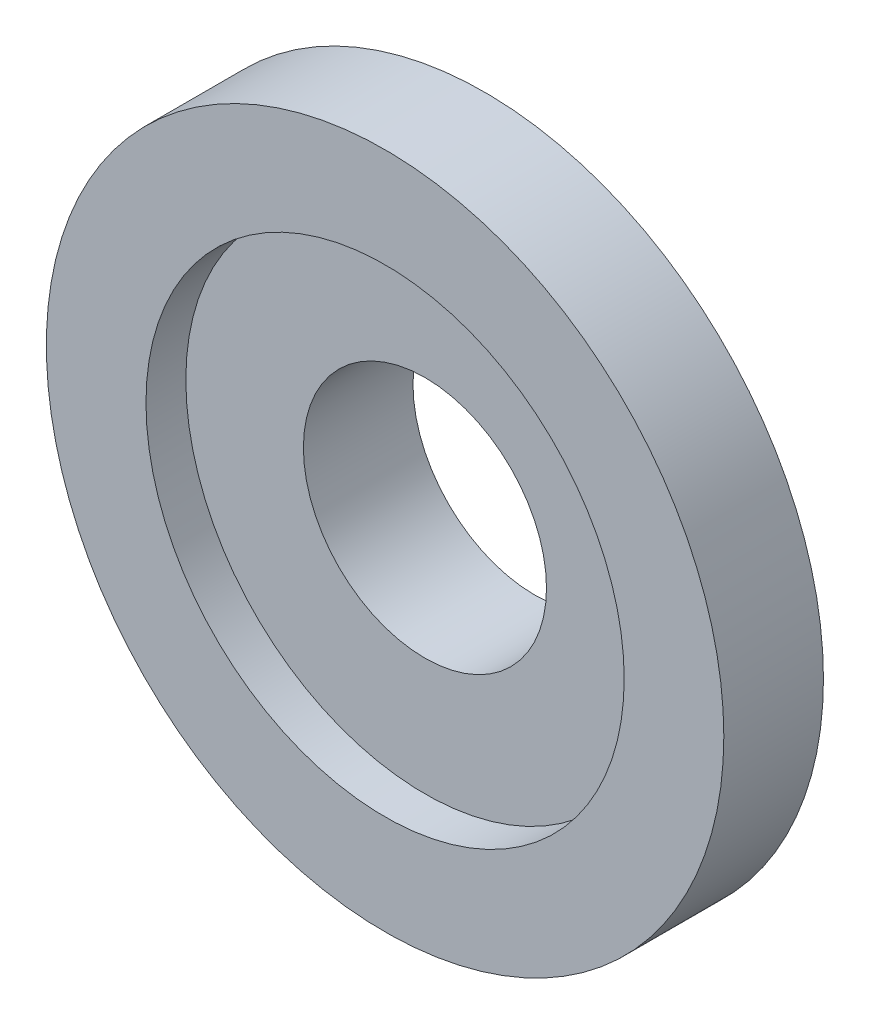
ISO-10303-21;
HEADER;
FILE_DESCRIPTION(('STEP AP214'),'2;1');
FILE_NAME('part.step','',(''),(''),'','','');
FILE_SCHEMA(('AUTOMOTIVE_DESIGN { 1 0 10303 214 1 1 1 1 }'));
ENDSEC;
DATA;
#1=APPLICATION_CONTEXT('core data for automotive mechanical design processes');
#2=APPLICATION_PROTOCOL_DEFINITION('international standard','automotive_design',2000,#1);
#3=PRODUCT_CONTEXT('',#1,'mechanical');
#4=PRODUCT('Part','Part','',(#3));
#5=PRODUCT_RELATED_PRODUCT_CATEGORY('part','',(#4));
#6=PRODUCT_DEFINITION_FORMATION('','',#4);
#7=PRODUCT_DEFINITION_CONTEXT('part definition',#1,'design');
#8=PRODUCT_DEFINITION('design','',#6,#7);
#9=PRODUCT_DEFINITION_SHAPE('','',#8);
#10=(LENGTH_UNIT() NAMED_UNIT(*) SI_UNIT(.MILLI.,.METRE.));
#11=(NAMED_UNIT(*) PLANE_ANGLE_UNIT() SI_UNIT($,.RADIAN.));
#12=(NAMED_UNIT(*) SI_UNIT($,.STERADIAN.) SOLID_ANGLE_UNIT());
#13=UNCERTAINTY_MEASURE_WITH_UNIT(LENGTH_MEASURE(1.E-05),#10,'distance_accuracy_value','');
#14=(GEOMETRIC_REPRESENTATION_CONTEXT(3) GLOBAL_UNCERTAINTY_ASSIGNED_CONTEXT((#13)) GLOBAL_UNIT_ASSIGNED_CONTEXT((#10,
#11,#12)) REPRESENTATION_CONTEXT('',''));
#15=CARTESIAN_POINT('',(0.,0.,0.));
#16=DIRECTION('',(0.,0.,1.));
#17=DIRECTION('',(1.,0.,0.));
#18=AXIS2_PLACEMENT_3D('',#15,#16,#17);
#19=CARTESIAN_POINT('',(0.,0.,3.));
#20=DIRECTION('',(0.,0.,1.));
#21=DIRECTION('',(1.,0.,0.));
#22=AXIS2_PLACEMENT_3D('',#19,#20,#21);
#23=PLANE('',#22);
#24=CARTESIAN_POINT('',(0.,0.,3.));
#25=DIRECTION('',(0.,0.,-1.));
#26=DIRECTION('',(-1.,0.,0.));
#27=AXIS2_PLACEMENT_3D('',#24,#25,#26);
#28=CIRCLE('',#27,6.1);
#29=CARTESIAN_POINT('',(-6.1,0.,3.));
#30=VERTEX_POINT('',#29);
#31=EDGE_CURVE('E60',#30,#30,#28,.T.);
#32=ORIENTED_EDGE('',*,*,#31,.T.);
#33=EDGE_LOOP('',(#32));
#34=FACE_BOUND('',#33,.T.);
#35=CARTESIAN_POINT('',(0.,0.,3.));
#36=DIRECTION('',(0.,0.,1.));
#37=DIRECTION('',(1.,0.,0.));
#38=AXIS2_PLACEMENT_3D('',#35,#36,#37);
#39=CIRCLE('',#38,12.);
#40=CARTESIAN_POINT('',(12.,0.,3.));
#41=VERTEX_POINT('',#40);
#42=EDGE_CURVE('E10',#41,#41,#39,.F.);
#43=ORIENTED_EDGE('',*,*,#42,.F.);
#44=EDGE_LOOP('',(#43));
#45=FACE_BOUND('',#44,.T.);
#46=ADVANCED_FACE('F37',(#34,#45),#23,.T.);
#47=CARTESIAN_POINT('',(0.,0.,0.));
#48=DIRECTION('',(0.,0.,1.));
#49=DIRECTION('',(1.,0.,0.));
#50=AXIS2_PLACEMENT_3D('',#47,#48,#49);
#51=PLANE('',#50);
#52=CARTESIAN_POINT('',(0.,0.,0.));
#53=DIRECTION('',(0.,0.,1.));
#54=DIRECTION('',(1.,0.,0.));
#55=AXIS2_PLACEMENT_3D('',#52,#53,#54);
#56=CIRCLE('',#55,7.5);
#57=CARTESIAN_POINT('',(7.5,0.,0.));
#58=VERTEX_POINT('',#57);
#59=EDGE_CURVE('E44',#58,#58,#56,.F.);
#60=ORIENTED_EDGE('',*,*,#59,.F.);
#61=EDGE_LOOP('',(#60));
#62=FACE_BOUND('',#61,.T.);
#63=CARTESIAN_POINT('',(0.,0.,0.));
#64=DIRECTION('',(0.,0.,-1.));
#65=DIRECTION('',(-1.,0.,0.));
#66=AXIS2_PLACEMENT_3D('',#63,#64,#65);
#67=CIRCLE('',#66,10.);
#68=CARTESIAN_POINT('',(-10.,0.,0.));
#69=VERTEX_POINT('',#68);
#70=EDGE_CURVE('E70',#69,#69,#67,.T.);
#71=ORIENTED_EDGE('',*,*,#70,.T.);
#72=EDGE_LOOP('',(#71));
#73=FACE_BOUND('',#72,.T.);
#74=ADVANCED_FACE('F98',(#62,#73),#51,.F.);
#75=CARTESIAN_POINT('',(0.,0.,3.));
#76=DIRECTION('',(0.,0.,-1.));
#77=DIRECTION('',(-1.,0.,0.));
#78=AXIS2_PLACEMENT_3D('',#75,#76,#77);
#79=CYLINDRICAL_SURFACE('',#78,17.);
#80=CARTESIAN_POINT('',(0.,0.,0.));
#81=DIRECTION('',(0.,0.,1.));
#82=DIRECTION('',(1.,0.,0.));
#83=AXIS2_PLACEMENT_3D('',#80,#81,#82);
#84=CIRCLE('',#83,17.);
#85=CARTESIAN_POINT('',(17.,0.,0.));
#86=VERTEX_POINT('',#85);
#87=EDGE_CURVE('E48',#86,#86,#84,.T.);
#88=ORIENTED_EDGE('',*,*,#87,.T.);
#89=EDGE_LOOP('',(#88));
#90=FACE_BOUND('',#89,.T.);
#91=CARTESIAN_POINT('',(0.,0.,5.));
#92=DIRECTION('',(0.,0.,1.));
#93=DIRECTION('',(1.,0.,0.));
#94=AXIS2_PLACEMENT_3D('',#91,#92,#93);
#95=CIRCLE('',#94,17.);
#96=CARTESIAN_POINT('',(17.,0.,5.));
#97=VERTEX_POINT('',#96);
#98=EDGE_CURVE('E73',#97,#97,#95,.T.);
#99=ORIENTED_EDGE('',*,*,#98,.F.);
#100=EDGE_LOOP('',(#99));
#101=FACE_BOUND('',#100,.T.);
#102=ADVANCED_FACE('F39',(#90,#101),#79,.T.);
#103=CARTESIAN_POINT('',(0.,0.,0.));
#104=DIRECTION('',(0.,0.,-1.));
#105=DIRECTION('',(-1.,0.,0.));
#106=AXIS2_PLACEMENT_3D('',#103,#104,#105);
#107=CIRCLE('',#106,12.);
#108=CARTESIAN_POINT('',(-12.,0.,0.));
#109=VERTEX_POINT('',#108);
#110=EDGE_CURVE('E64',#109,#109,#107,.T.);
#111=ORIENTED_EDGE('',*,*,#110,.F.);
#112=EDGE_LOOP('',(#111));
#113=FACE_BOUND('',#112,.T.);
#114=ORIENTED_EDGE('',*,*,#87,.F.);
#115=EDGE_LOOP('',(#114));
#116=FACE_BOUND('',#115,.T.);
#117=ADVANCED_FACE('F105',(#113,#116),#51,.F.);
#118=CARTESIAN_POINT('',(0.,0.,-2.5));
#119=DIRECTION('',(0.,0.,-1.));
#120=DIRECTION('',(-1.,0.,0.));
#121=AXIS2_PLACEMENT_3D('',#118,#119,#120);
#122=PLANE('',#121);
#123=CARTESIAN_POINT('',(0.,0.,-2.5));
#124=DIRECTION('',(0.,0.,-1.));
#125=DIRECTION('',(-1.,0.,0.));
#126=AXIS2_PLACEMENT_3D('',#123,#124,#125);
#127=CIRCLE('',#126,7.5);
#128=CARTESIAN_POINT('',(-7.5,0.,-2.5));
#129=VERTEX_POINT('',#128);
#130=EDGE_CURVE('E52',#129,#129,#127,.T.);
#131=ORIENTED_EDGE('',*,*,#130,.T.);
#132=EDGE_LOOP('',(#131));
#133=FACE_BOUND('',#132,.T.);
#134=CARTESIAN_POINT('',(0.,0.,-2.5));
#135=DIRECTION('',(0.,0.,-1.));
#136=DIRECTION('',(-1.,0.,0.));
#137=AXIS2_PLACEMENT_3D('',#134,#135,#136);
#138=CIRCLE('',#137,6.1);
#139=CARTESIAN_POINT('',(-6.1,0.,-2.5));
#140=VERTEX_POINT('',#139);
#141=EDGE_CURVE('E57',#140,#140,#138,.T.);
#142=ORIENTED_EDGE('',*,*,#141,.F.);
#143=EDGE_LOOP('',(#142));
#144=FACE_BOUND('',#143,.T.);
#145=ADVANCED_FACE('F111',(#133,#144),#122,.T.);
#146=CARTESIAN_POINT('',(0.,0.,-2.5));
#147=DIRECTION('',(0.,0.,1.));
#148=DIRECTION('',(1.,0.,0.));
#149=AXIS2_PLACEMENT_3D('',#146,#147,#148);
#150=CYLINDRICAL_SURFACE('',#149,7.5);
#151=ORIENTED_EDGE('',*,*,#130,.F.);
#152=EDGE_LOOP('',(#151));
#153=FACE_BOUND('',#152,.T.);
#154=ORIENTED_EDGE('',*,*,#59,.T.);
#155=EDGE_LOOP('',(#154));
#156=FACE_BOUND('',#155,.T.);
#157=ADVANCED_FACE('F108',(#153,#156),#150,.T.);
#158=CARTESIAN_POINT('',(0.,0.,-2.5));
#159=DIRECTION('',(0.,0.,1.));
#160=DIRECTION('',(1.,0.,0.));
#161=AXIS2_PLACEMENT_3D('',#158,#159,#160);
#162=CYLINDRICAL_SURFACE('',#161,6.1);
#163=ORIENTED_EDGE('',*,*,#141,.T.);
#164=EDGE_LOOP('',(#163));
#165=FACE_BOUND('',#164,.T.);
#166=ORIENTED_EDGE('',*,*,#31,.F.);
#167=EDGE_LOOP('',(#166));
#168=FACE_BOUND('',#167,.T.);
#169=ADVANCED_FACE('F127',(#165,#168),#162,.F.);
#170=CARTESIAN_POINT('',(0.,0.,0.2));
#171=DIRECTION('',(0.,0.,-1.));
#172=DIRECTION('',(-1.,0.,0.));
#173=AXIS2_PLACEMENT_3D('',#170,#171,#172);
#174=CYLINDRICAL_SURFACE('',#173,12.);
#175=CARTESIAN_POINT('',(0.,0.,0.2));
#176=DIRECTION('',(0.,0.,-1.));
#177=DIRECTION('',(-1.,0.,0.));
#178=AXIS2_PLACEMENT_3D('',#175,#176,#177);
#179=CIRCLE('',#178,12.);
#180=CARTESIAN_POINT('',(-12.,0.,0.2));
#181=VERTEX_POINT('',#180);
#182=EDGE_CURVE('E63',#181,#181,#179,.T.);
#183=ORIENTED_EDGE('',*,*,#182,.F.);
#184=EDGE_LOOP('',(#183));
#185=FACE_BOUND('',#184,.T.);
#186=ORIENTED_EDGE('',*,*,#110,.T.);
#187=EDGE_LOOP('',(#186));
#188=FACE_BOUND('',#187,.T.);
#189=ADVANCED_FACE('F125',(#185,#188),#174,.F.);
#190=CARTESIAN_POINT('',(0.,0.,0.2));
#191=DIRECTION('',(0.,0.,-1.));
#192=DIRECTION('',(-1.,0.,0.));
#193=AXIS2_PLACEMENT_3D('',#190,#191,#192);
#194=PLANE('',#193);
#195=CARTESIAN_POINT('',(0.,0.,0.2));
#196=DIRECTION('',(0.,0.,-1.));
#197=DIRECTION('',(-1.,0.,0.));
#198=AXIS2_PLACEMENT_3D('',#195,#196,#197);
#199=CIRCLE('',#198,10.);
#200=CARTESIAN_POINT('',(-10.,0.,0.2));
#201=VERTEX_POINT('',#200);
#202=EDGE_CURVE('E67',#201,#201,#199,.T.);
#203=ORIENTED_EDGE('',*,*,#202,.F.);
#204=EDGE_LOOP('',(#203));
#205=FACE_BOUND('',#204,.T.);
#206=ORIENTED_EDGE('',*,*,#182,.T.);
#207=EDGE_LOOP('',(#206));
#208=FACE_BOUND('',#207,.T.);
#209=ADVANCED_FACE('F94',(#205,#208),#194,.T.);
#210=CARTESIAN_POINT('',(0.,0.,0.2));
#211=DIRECTION('',(0.,0.,-1.));
#212=DIRECTION('',(-1.,0.,0.));
#213=AXIS2_PLACEMENT_3D('',#210,#211,#212);
#214=CYLINDRICAL_SURFACE('',#213,10.);
#215=ORIENTED_EDGE('',*,*,#202,.T.);
#216=EDGE_LOOP('',(#215));
#217=FACE_BOUND('',#216,.T.);
#218=ORIENTED_EDGE('',*,*,#70,.F.);
#219=EDGE_LOOP('',(#218));
#220=FACE_BOUND('',#219,.T.);
#221=ADVANCED_FACE('F86',(#217,#220),#214,.T.);
#222=CARTESIAN_POINT('',(0.,0.,5.));
#223=DIRECTION('',(0.,0.,1.));
#224=DIRECTION('',(1.,0.,0.));
#225=AXIS2_PLACEMENT_3D('',#222,#223,#224);
#226=PLANE('',#225);
#227=ORIENTED_EDGE('',*,*,#98,.T.);
#228=EDGE_LOOP('',(#227));
#229=FACE_BOUND('',#228,.T.);
#230=CARTESIAN_POINT('',(0.,0.,5.));
#231=DIRECTION('',(0.,0.,1.));
#232=DIRECTION('',(1.,0.,0.));
#233=AXIS2_PLACEMENT_3D('',#230,#231,#232);
#234=CIRCLE('',#233,12.);
#235=CARTESIAN_POINT('',(12.,0.,5.));
#236=VERTEX_POINT('',#235);
#237=EDGE_CURVE('E78',#236,#236,#234,.T.);
#238=ORIENTED_EDGE('',*,*,#237,.F.);
#239=EDGE_LOOP('',(#238));
#240=FACE_BOUND('',#239,.T.);
#241=ADVANCED_FACE('F84',(#229,#240),#226,.T.);
#242=CARTESIAN_POINT('',(0.,0.,5.));
#243=DIRECTION('',(0.,0.,-1.));
#244=DIRECTION('',(-1.,0.,0.));
#245=AXIS2_PLACEMENT_3D('',#242,#243,#244);
#246=CYLINDRICAL_SURFACE('',#245,12.);
#247=ORIENTED_EDGE('',*,*,#237,.T.);
#248=EDGE_LOOP('',(#247));
#249=FACE_BOUND('',#248,.T.);
#250=ORIENTED_EDGE('',*,*,#42,.T.);
#251=EDGE_LOOP('',(#250));
#252=FACE_BOUND('',#251,.T.);
#253=ADVANCED_FACE('F82',(#249,#252),#246,.F.);
#254=CLOSED_SHELL('',(#46,#74,#102,#117,#145,#157,#169,#189,#209,#221,#241,#253));
#255=MANIFOLD_SOLID_BREP('B2',#254);
#256=ADVANCED_BREP_SHAPE_REPRESENTATION('',(#18,#255),#14);
#257=SHAPE_DEFINITION_REPRESENTATION(#9,#256);
ENDSEC;
END-ISO-10303-21;
